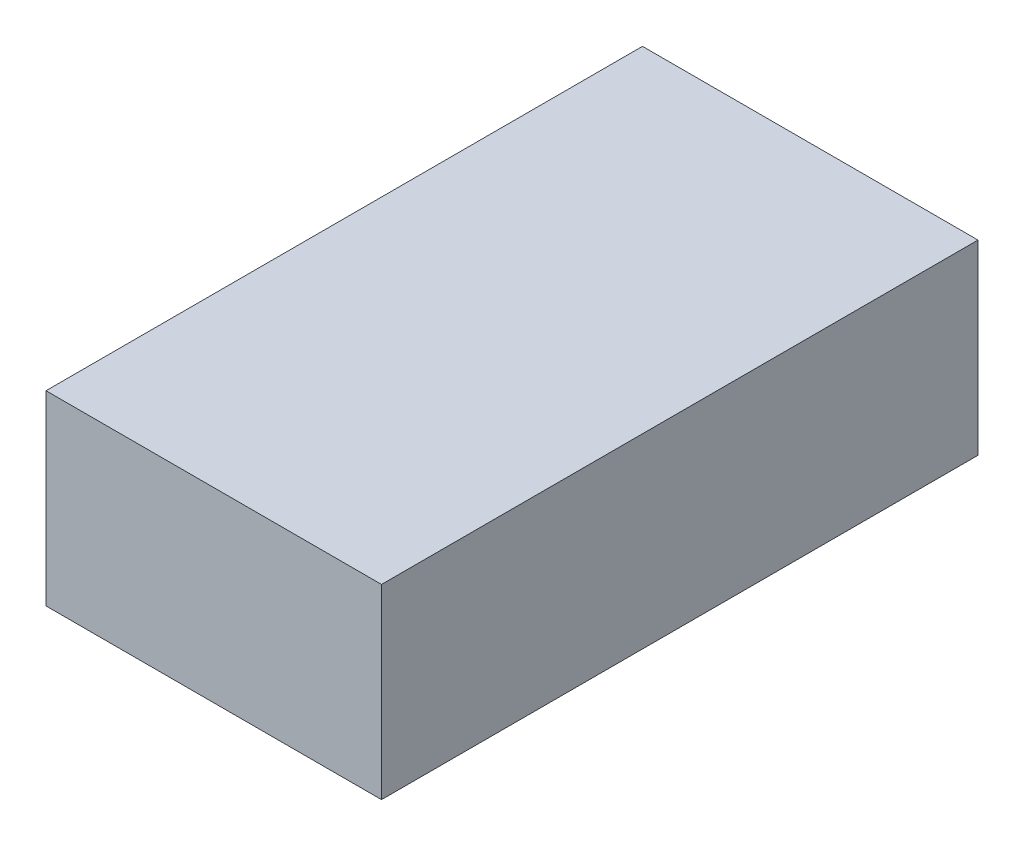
ISO-10303-21;
HEADER;
FILE_DESCRIPTION(('STEP AP214'),'2;1');
FILE_NAME('part.step','',(''),(''),'','','');
FILE_SCHEMA(('AUTOMOTIVE_DESIGN { 1 0 10303 214 1 1 1 1 }'));
ENDSEC;
DATA;
#1=APPLICATION_CONTEXT('core data for automotive mechanical design processes');
#2=APPLICATION_PROTOCOL_DEFINITION('international standard','automotive_design',2000,#1);
#3=PRODUCT_CONTEXT('',#1,'mechanical');
#4=PRODUCT('Part','Part','',(#3));
#5=PRODUCT_RELATED_PRODUCT_CATEGORY('part','',(#4));
#6=PRODUCT_DEFINITION_FORMATION('','',#4);
#7=PRODUCT_DEFINITION_CONTEXT('part definition',#1,'design');
#8=PRODUCT_DEFINITION('design','',#6,#7);
#9=PRODUCT_DEFINITION_SHAPE('','',#8);
#10=(LENGTH_UNIT() NAMED_UNIT(*) SI_UNIT(.MILLI.,.METRE.));
#11=(NAMED_UNIT(*) PLANE_ANGLE_UNIT() SI_UNIT($,.RADIAN.));
#12=(NAMED_UNIT(*) SI_UNIT($,.STERADIAN.) SOLID_ANGLE_UNIT());
#13=UNCERTAINTY_MEASURE_WITH_UNIT(LENGTH_MEASURE(1.E-05),#10,'distance_accuracy_value','');
#14=(GEOMETRIC_REPRESENTATION_CONTEXT(3) GLOBAL_UNCERTAINTY_ASSIGNED_CONTEXT((#13)) GLOBAL_UNIT_ASSIGNED_CONTEXT((#10,
#11,#12)) REPRESENTATION_CONTEXT('',''));
#15=CARTESIAN_POINT('',(0.,0.,0.));
#16=DIRECTION('',(0.,0.,1.));
#17=DIRECTION('',(1.,0.,0.));
#18=AXIS2_PLACEMENT_3D('',#15,#16,#17);
#19=CARTESIAN_POINT('',(28.575,-15.875,101.6));
#20=DIRECTION('',(-1.,0.,0.));
#21=DIRECTION('',(0.,0.,1.));
#22=AXIS2_PLACEMENT_3D('',#19,#20,#21);
#23=PLANE('',#22);
#24=DIRECTION('',(0.,1.,0.));
#25=VECTOR('',#24,1.);
#26=CARTESIAN_POINT('',(28.575,-15.875,0.));
#27=LINE('',#26,#25);
#28=CARTESIAN_POINT('',(28.575,-15.875,0.));
#29=VERTEX_POINT('',#28);
#30=CARTESIAN_POINT('',(28.575,15.875,0.));
#31=VERTEX_POINT('',#30);
#32=EDGE_CURVE('E97',#29,#31,#27,.T.);
#33=ORIENTED_EDGE('',*,*,#32,.T.);
#34=DIRECTION('',(0.,0.,-1.));
#35=VECTOR('',#34,1.);
#36=CARTESIAN_POINT('',(28.575,15.875,101.6));
#37=LINE('',#36,#35);
#38=CARTESIAN_POINT('',(28.575,15.875,101.6));
#39=VERTEX_POINT('',#38);
#40=EDGE_CURVE('E11',#39,#31,#37,.T.);
#41=ORIENTED_EDGE('',*,*,#40,.F.);
#42=DIRECTION('',(0.,1.,0.));
#43=VECTOR('',#42,1.);
#44=CARTESIAN_POINT('',(28.575,-15.875,101.6));
#45=LINE('',#44,#43);
#46=CARTESIAN_POINT('',(28.575,-15.875,101.6));
#47=VERTEX_POINT('',#46);
#48=EDGE_CURVE('E85',#47,#39,#45,.T.);
#49=ORIENTED_EDGE('',*,*,#48,.F.);
#50=DIRECTION('',(0.,0.,-1.));
#51=VECTOR('',#50,1.);
#52=CARTESIAN_POINT('',(28.575,-15.875,101.6));
#53=LINE('',#52,#51);
#54=EDGE_CURVE('E93',#47,#29,#53,.T.);
#55=ORIENTED_EDGE('',*,*,#54,.T.);
#56=EDGE_LOOP('',(#33,#41,#49,#55));
#57=FACE_BOUND('',#56,.T.);
#58=ADVANCED_FACE('F34',(#57),#23,.F.);
#59=CARTESIAN_POINT('',(-28.575,15.875,101.6));
#60=DIRECTION('',(0.,-1.,0.));
#61=DIRECTION('',(0.,0.,-1.));
#62=AXIS2_PLACEMENT_3D('',#59,#60,#61);
#63=PLANE('',#62);
#64=DIRECTION('',(-1.,0.,0.));
#65=VECTOR('',#64,1.);
#66=CARTESIAN_POINT('',(-28.575,15.875,0.));
#67=LINE('',#66,#65);
#68=CARTESIAN_POINT('',(-28.575,15.875,0.));
#69=VERTEX_POINT('',#68);
#70=EDGE_CURVE('E89',#31,#69,#67,.T.);
#71=ORIENTED_EDGE('',*,*,#70,.T.);
#72=DIRECTION('',(0.,0.,-1.));
#73=VECTOR('',#72,1.);
#74=CARTESIAN_POINT('',(-28.575,15.875,101.6));
#75=LINE('',#74,#73);
#76=CARTESIAN_POINT('',(-28.575,15.875,101.6));
#77=VERTEX_POINT('',#76);
#78=EDGE_CURVE('E42',#77,#69,#75,.T.);
#79=ORIENTED_EDGE('',*,*,#78,.F.);
#80=DIRECTION('',(-1.,0.,0.));
#81=VECTOR('',#80,1.);
#82=CARTESIAN_POINT('',(-28.575,15.875,101.6));
#83=LINE('',#82,#81);
#84=EDGE_CURVE('E80',#39,#77,#83,.T.);
#85=ORIENTED_EDGE('',*,*,#84,.F.);
#86=ORIENTED_EDGE('',*,*,#40,.T.);
#87=EDGE_LOOP('',(#71,#79,#85,#86));
#88=FACE_BOUND('',#87,.T.);
#89=ADVANCED_FACE('F88',(#88),#63,.F.);
#90=CARTESIAN_POINT('',(-28.575,-15.875,101.6));
#91=DIRECTION('',(1.,0.,0.));
#92=DIRECTION('',(0.,0.,-1.));
#93=AXIS2_PLACEMENT_3D('',#90,#91,#92);
#94=PLANE('',#93);
#95=DIRECTION('',(0.,-1.,0.));
#96=VECTOR('',#95,1.);
#97=CARTESIAN_POINT('',(-28.575,-15.875,0.));
#98=LINE('',#97,#96);
#99=CARTESIAN_POINT('',(-28.575,-15.875,0.));
#100=VERTEX_POINT('',#99);
#101=EDGE_CURVE('E67',#69,#100,#98,.T.);
#102=ORIENTED_EDGE('',*,*,#101,.T.);
#103=DIRECTION('',(0.,0.,-1.));
#104=VECTOR('',#103,1.);
#105=CARTESIAN_POINT('',(-28.575,-15.875,101.6));
#106=LINE('',#105,#104);
#107=CARTESIAN_POINT('',(-28.575,-15.875,101.6));
#108=VERTEX_POINT('',#107);
#109=EDGE_CURVE('E90',#108,#100,#106,.T.);
#110=ORIENTED_EDGE('',*,*,#109,.F.);
#111=DIRECTION('',(0.,-1.,0.));
#112=VECTOR('',#111,1.);
#113=CARTESIAN_POINT('',(-28.575,-15.875,101.6));
#114=LINE('',#113,#112);
#115=EDGE_CURVE('E83',#77,#108,#114,.T.);
#116=ORIENTED_EDGE('',*,*,#115,.F.);
#117=ORIENTED_EDGE('',*,*,#78,.T.);
#118=EDGE_LOOP('',(#102,#110,#116,#117));
#119=FACE_BOUND('',#118,.T.);
#120=ADVANCED_FACE('F91',(#119),#94,.F.);
#121=CARTESIAN_POINT('',(-28.575,-15.875,101.6));
#122=DIRECTION('',(0.,1.,0.));
#123=DIRECTION('',(0.,0.,1.));
#124=AXIS2_PLACEMENT_3D('',#121,#122,#123);
#125=PLANE('',#124);
#126=DIRECTION('',(1.,0.,0.));
#127=VECTOR('',#126,1.);
#128=CARTESIAN_POINT('',(-28.575,-15.875,0.));
#129=LINE('',#128,#127);
#130=EDGE_CURVE('E73',#100,#29,#129,.T.);
#131=ORIENTED_EDGE('',*,*,#130,.T.);
#132=ORIENTED_EDGE('',*,*,#54,.F.);
#133=DIRECTION('',(1.,0.,0.));
#134=VECTOR('',#133,1.);
#135=CARTESIAN_POINT('',(-28.575,-15.875,101.6));
#136=LINE('',#135,#134);
#137=EDGE_CURVE('E50',#108,#47,#136,.T.);
#138=ORIENTED_EDGE('',*,*,#137,.F.);
#139=ORIENTED_EDGE('',*,*,#109,.T.);
#140=EDGE_LOOP('',(#131,#132,#138,#139));
#141=FACE_BOUND('',#140,.T.);
#142=ADVANCED_FACE('F104',(#141),#125,.F.);
#143=CARTESIAN_POINT('',(0.,0.,101.6));
#144=DIRECTION('',(0.,0.,-1.));
#145=DIRECTION('',(-1.,0.,0.));
#146=AXIS2_PLACEMENT_3D('',#143,#144,#145);
#147=PLANE('',#146);
#148=ORIENTED_EDGE('',*,*,#48,.T.);
#149=ORIENTED_EDGE('',*,*,#84,.T.);
#150=ORIENTED_EDGE('',*,*,#115,.T.);
#151=ORIENTED_EDGE('',*,*,#137,.T.);
#152=EDGE_LOOP('',(#148,#149,#150,#151));
#153=FACE_BOUND('',#152,.T.);
#154=ADVANCED_FACE('F81',(#153),#147,.F.);
#155=CARTESIAN_POINT('',(0.,0.,0.));
#156=DIRECTION('',(0.,0.,-1.));
#157=DIRECTION('',(-1.,0.,0.));
#158=AXIS2_PLACEMENT_3D('',#155,#156,#157);
#159=PLANE('',#158);
#160=ORIENTED_EDGE('',*,*,#32,.F.);
#161=ORIENTED_EDGE('',*,*,#130,.F.);
#162=ORIENTED_EDGE('',*,*,#101,.F.);
#163=ORIENTED_EDGE('',*,*,#70,.F.);
#164=EDGE_LOOP('',(#160,#161,#162,#163));
#165=FACE_BOUND('',#164,.T.);
#166=ADVANCED_FACE('F107',(#165),#159,.T.);
#167=CLOSED_SHELL('',(#58,#89,#120,#142,#154,#166));
#168=MANIFOLD_SOLID_BREP('B2',#167);
#169=ADVANCED_BREP_SHAPE_REPRESENTATION('',(#18,#168),#14);
#170=SHAPE_DEFINITION_REPRESENTATION(#9,#169);
ENDSEC;
END-ISO-10303-21;
